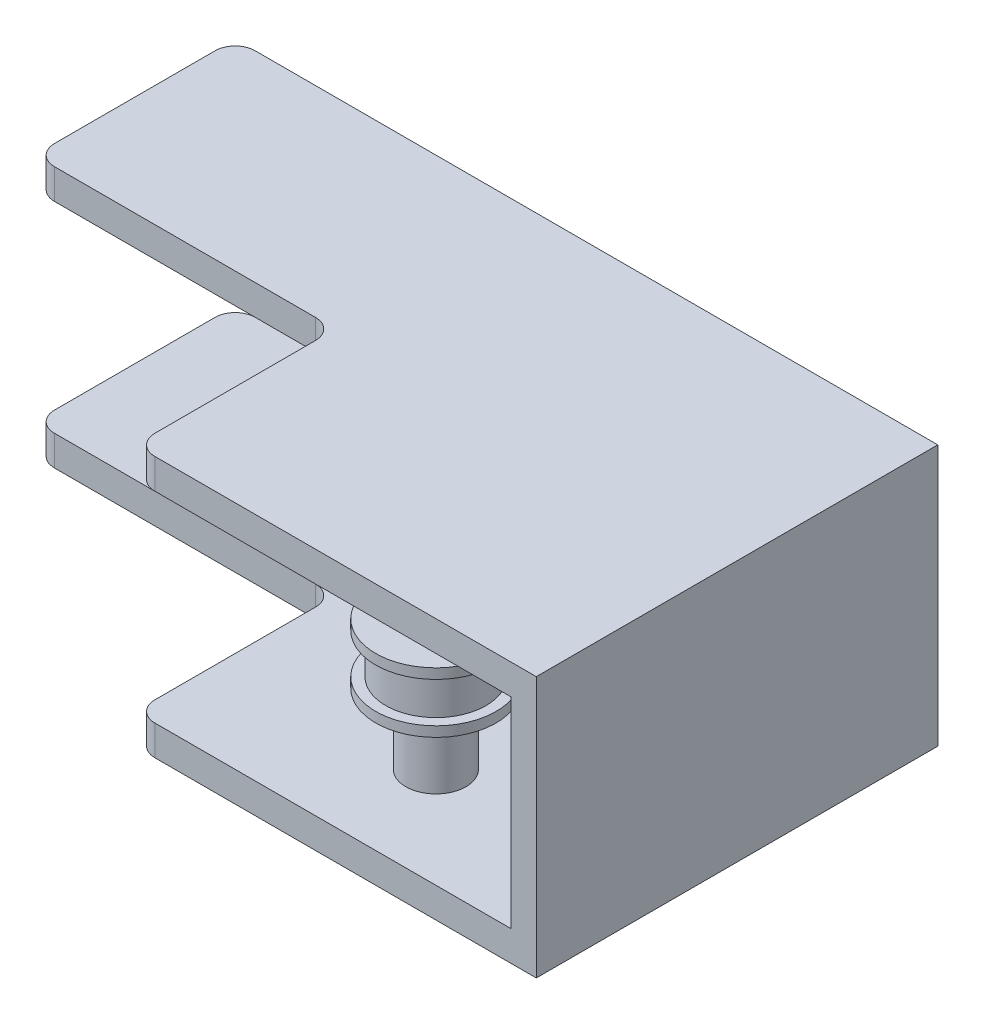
ISO-10303-21;
HEADER;
FILE_DESCRIPTION(('STEP AP214'),'2;1');
FILE_NAME('part.step','',(''),(''),'','','');
FILE_SCHEMA(('AUTOMOTIVE_DESIGN { 1 0 10303 214 1 1 1 1 }'));
ENDSEC;
DATA;
#1=APPLICATION_CONTEXT('core data for automotive mechanical design processes');
#2=APPLICATION_PROTOCOL_DEFINITION('international standard','automotive_design',2000,#1);
#3=PRODUCT_CONTEXT('',#1,'mechanical');
#4=PRODUCT('Part','Part','',(#3));
#5=PRODUCT_RELATED_PRODUCT_CATEGORY('part','',(#4));
#6=PRODUCT_DEFINITION_FORMATION('','',#4);
#7=PRODUCT_DEFINITION_CONTEXT('part definition',#1,'design');
#8=PRODUCT_DEFINITION('design','',#6,#7);
#9=PRODUCT_DEFINITION_SHAPE('','',#8);
#10=(LENGTH_UNIT() NAMED_UNIT(*) SI_UNIT(.MILLI.,.METRE.));
#11=(NAMED_UNIT(*) PLANE_ANGLE_UNIT() SI_UNIT($,.RADIAN.));
#12=(NAMED_UNIT(*) SI_UNIT($,.STERADIAN.) SOLID_ANGLE_UNIT());
#13=UNCERTAINTY_MEASURE_WITH_UNIT(LENGTH_MEASURE(1.E-05),#10,'distance_accuracy_value','');
#14=(GEOMETRIC_REPRESENTATION_CONTEXT(3) GLOBAL_UNCERTAINTY_ASSIGNED_CONTEXT((#13)) GLOBAL_UNIT_ASSIGNED_CONTEXT((#10,
#11,#12)) REPRESENTATION_CONTEXT('',''));
#15=CARTESIAN_POINT('',(0.,0.,0.));
#16=DIRECTION('',(0.,0.,1.));
#17=DIRECTION('',(1.,0.,0.));
#18=AXIS2_PLACEMENT_3D('',#15,#16,#17);
#19=CARTESIAN_POINT('',(-18.,0.,18.));
#20=DIRECTION('',(0.,-1.,0.));
#21=DIRECTION('',(0.,0.,-1.));
#22=AXIS2_PLACEMENT_3D('',#19,#20,#21);
#23=PLANE('',#22);
#24=CARTESIAN_POINT('',(0.,0.,10.));
#25=DIRECTION('',(0.,-1.,0.));
#26=DIRECTION('',(0.,0.,-1.));
#27=AXIS2_PLACEMENT_3D('',#24,#25,#26);
#28=CIRCLE('',#27,3.);
#29=CARTESIAN_POINT('',(0.,0.,7.));
#30=VERTEX_POINT('',#29);
#31=EDGE_CURVE('E237',#30,#30,#28,.T.);
#32=ORIENTED_EDGE('',*,*,#31,.F.);
#33=EDGE_LOOP('',(#32));
#34=FACE_BOUND('',#33,.T.);
#35=DIRECTION('',(-1.,0.,0.));
#36=VECTOR('',#35,1.);
#37=CARTESIAN_POINT('',(-48.,0.,-20.));
#38=LINE('',#37,#36);
#39=CARTESIAN_POINT('',(17.5,0.,-20.));
#40=VERTEX_POINT('',#39);
#41=CARTESIAN_POINT('',(-48.,0.,-20.));
#42=VERTEX_POINT('',#41);
#43=EDGE_CURVE('E161',#40,#42,#38,.T.);
#44=ORIENTED_EDGE('',*,*,#43,.F.);
#45=DIRECTION('',(0.,0.,-1.));
#46=VECTOR('',#45,1.);
#47=CARTESIAN_POINT('',(17.5,0.,-20.));
#48=LINE('',#47,#46);
#49=CARTESIAN_POINT('',(17.5,0.,20.));
#50=VERTEX_POINT('',#49);
#51=EDGE_CURVE('E317',#50,#40,#48,.T.);
#52=ORIENTED_EDGE('',*,*,#51,.F.);
#53=DIRECTION('',(1.,0.,0.));
#54=VECTOR('',#53,1.);
#55=CARTESIAN_POINT('',(18.,0.,20.));
#56=LINE('',#55,#54);
#57=CARTESIAN_POINT('',(-18.,0.,20.));
#58=VERTEX_POINT('',#57);
#59=EDGE_CURVE('E103',#58,#50,#56,.T.);
#60=ORIENTED_EDGE('',*,*,#59,.F.);
#61=CARTESIAN_POINT('',(-18.,0.,18.));
#62=DIRECTION('',(0.,1.,0.));
#63=DIRECTION('',(0.,0.,-1.));
#64=AXIS2_PLACEMENT_3D('',#61,#62,#63);
#65=CIRCLE('',#64,2.);
#66=CARTESIAN_POINT('',(-20.,0.,18.));
#67=VERTEX_POINT('',#66);
#68=EDGE_CURVE('E182',#67,#58,#65,.T.);
#69=ORIENTED_EDGE('',*,*,#68,.F.);
#70=DIRECTION('',(0.,0.,1.));
#71=VECTOR('',#70,1.);
#72=CARTESIAN_POINT('',(-20.,0.,2.00000000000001));
#73=LINE('',#72,#71);
#74=CARTESIAN_POINT('',(-20.,0.,2.00000000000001));
#75=VERTEX_POINT('',#74);
#76=EDGE_CURVE('E95',#75,#67,#73,.T.);
#77=ORIENTED_EDGE('',*,*,#76,.F.);
#78=CARTESIAN_POINT('',(-22.,0.,2.));
#79=DIRECTION('',(0.,-1.,0.));
#80=DIRECTION('',(0.,0.,1.));
#81=AXIS2_PLACEMENT_3D('',#78,#79,#80);
#82=CIRCLE('',#81,2.);
#83=CARTESIAN_POINT('',(-22.,0.,0.));
#84=VERTEX_POINT('',#83);
#85=EDGE_CURVE('E177',#84,#75,#82,.T.);
#86=ORIENTED_EDGE('',*,*,#85,.F.);
#87=DIRECTION('',(1.,0.,0.));
#88=VECTOR('',#87,1.);
#89=CARTESIAN_POINT('',(-22.,0.,0.));
#90=LINE('',#89,#88);
#91=CARTESIAN_POINT('',(-48.,0.,0.));
#92=VERTEX_POINT('',#91);
#93=EDGE_CURVE('E174',#92,#84,#90,.T.);
#94=ORIENTED_EDGE('',*,*,#93,.F.);
#95=CARTESIAN_POINT('',(-48.,0.,-2.));
#96=DIRECTION('',(0.,1.,0.));
#97=DIRECTION('',(0.,0.,-1.));
#98=AXIS2_PLACEMENT_3D('',#95,#96,#97);
#99=CIRCLE('',#98,2.);
#100=CARTESIAN_POINT('',(-50.,0.,-2.00000000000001));
#101=VERTEX_POINT('',#100);
#102=EDGE_CURVE('E171',#101,#92,#99,.T.);
#103=ORIENTED_EDGE('',*,*,#102,.F.);
#104=DIRECTION('',(0.,0.,1.));
#105=VECTOR('',#104,1.);
#106=CARTESIAN_POINT('',(-50.,0.,-2.00000000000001));
#107=LINE('',#106,#105);
#108=CARTESIAN_POINT('',(-50.,0.,-18.));
#109=VERTEX_POINT('',#108);
#110=EDGE_CURVE('E168',#109,#101,#107,.T.);
#111=ORIENTED_EDGE('',*,*,#110,.F.);
#112=CARTESIAN_POINT('',(-48.,0.,-18.));
#113=DIRECTION('',(0.,1.,0.));
#114=DIRECTION('',(0.,0.,1.));
#115=AXIS2_PLACEMENT_3D('',#112,#113,#114);
#116=CIRCLE('',#115,2.);
#117=EDGE_CURVE('E164',#42,#109,#116,.T.);
#118=ORIENTED_EDGE('',*,*,#117,.F.);
#119=EDGE_LOOP('',(#44,#52,#60,#69,#77,#86,#94,#103,#111,#118));
#120=FACE_BOUND('',#119,.T.);
#121=ADVANCED_FACE('F45',(#34,#120),#23,.T.);
#122=CARTESIAN_POINT('',(-48.,3.,-20.));
#123=DIRECTION('',(0.,0.,1.));
#124=DIRECTION('',(1.,0.,0.));
#125=AXIS2_PLACEMENT_3D('',#122,#123,#124);
#126=PLANE('',#125);
#127=DIRECTION('',(0.,-1.,0.));
#128=VECTOR('',#127,1.);
#129=CARTESIAN_POINT('',(20.,3.,-20.));
#130=LINE('',#129,#128);
#131=CARTESIAN_POINT('',(20.,3.,-20.));
#132=VERTEX_POINT('',#131);
#133=CARTESIAN_POINT('',(20.,-23.,-20.));
#134=VERTEX_POINT('',#133);
#135=EDGE_CURVE('E49',#132,#134,#130,.T.);
#136=ORIENTED_EDGE('',*,*,#135,.T.);
#137=DIRECTION('',(1.,0.,0.));
#138=VECTOR('',#137,1.);
#139=CARTESIAN_POINT('',(-48.,-23.,-20.));
#140=LINE('',#139,#138);
#141=CARTESIAN_POINT('',(-48.,-23.,-20.));
#142=VERTEX_POINT('',#141);
#143=EDGE_CURVE('E402',#142,#134,#140,.T.);
#144=ORIENTED_EDGE('',*,*,#143,.F.);
#145=DIRECTION('',(0.,1.,0.));
#146=VECTOR('',#145,1.);
#147=CARTESIAN_POINT('',(-48.,-23.,-20.));
#148=LINE('',#147,#146);
#149=CARTESIAN_POINT('',(-48.,-20.,-20.));
#150=VERTEX_POINT('',#149);
#151=EDGE_CURVE('E322',#142,#150,#148,.T.);
#152=ORIENTED_EDGE('',*,*,#151,.T.);
#153=DIRECTION('',(1.,0.,0.));
#154=VECTOR('',#153,1.);
#155=CARTESIAN_POINT('',(17.5,-20.,-20.));
#156=LINE('',#155,#154);
#157=CARTESIAN_POINT('',(17.5,-20.,-20.));
#158=VERTEX_POINT('',#157);
#159=EDGE_CURVE('E446',#150,#158,#156,.T.);
#160=ORIENTED_EDGE('',*,*,#159,.T.);
#161=DIRECTION('',(0.,1.,0.));
#162=VECTOR('',#161,1.);
#163=CARTESIAN_POINT('',(17.5,-20.,-20.));
#164=LINE('',#163,#162);
#165=EDGE_CURVE('E307',#158,#40,#164,.T.);
#166=ORIENTED_EDGE('',*,*,#165,.T.);
#167=ORIENTED_EDGE('',*,*,#43,.T.);
#168=DIRECTION('',(0.,-1.,0.));
#169=VECTOR('',#168,1.);
#170=CARTESIAN_POINT('',(-48.,3.,-20.));
#171=LINE('',#170,#169);
#172=CARTESIAN_POINT('',(-48.,3.,-20.));
#173=VERTEX_POINT('',#172);
#174=EDGE_CURVE('E210',#173,#42,#171,.T.);
#175=ORIENTED_EDGE('',*,*,#174,.F.);
#176=DIRECTION('',(-1.,0.,0.));
#177=VECTOR('',#176,1.);
#178=CARTESIAN_POINT('',(18.,3.,-20.));
#179=LINE('',#178,#177);
#180=EDGE_CURVE('E112',#132,#173,#179,.T.);
#181=ORIENTED_EDGE('',*,*,#180,.F.);
#182=EDGE_LOOP('',(#136,#144,#152,#160,#166,#167,#175,#181));
#183=FACE_BOUND('',#182,.T.);
#184=ADVANCED_FACE('F47',(#183),#126,.F.);
#185=CARTESIAN_POINT('',(-48.,3.,-18.));
#186=DIRECTION('',(0.,-1.,0.));
#187=DIRECTION('',(0.,0.,-1.));
#188=AXIS2_PLACEMENT_3D('',#185,#186,#187);
#189=CYLINDRICAL_SURFACE('',#188,2.);
#190=ORIENTED_EDGE('',*,*,#117,.T.);
#191=DIRECTION('',(0.,-1.,0.));
#192=VECTOR('',#191,1.);
#193=CARTESIAN_POINT('',(-50.,3.,-18.));
#194=LINE('',#193,#192);
#195=CARTESIAN_POINT('',(-50.,3.,-18.));
#196=VERTEX_POINT('',#195);
#197=EDGE_CURVE('E207',#196,#109,#194,.T.);
#198=ORIENTED_EDGE('',*,*,#197,.F.);
#199=CARTESIAN_POINT('',(-48.,3.,-18.));
#200=DIRECTION('',(0.,1.,0.));
#201=DIRECTION('',(0.,0.,1.));
#202=AXIS2_PLACEMENT_3D('',#199,#200,#201);
#203=CIRCLE('',#202,2.);
#204=EDGE_CURVE('E252',#173,#196,#203,.T.);
#205=ORIENTED_EDGE('',*,*,#204,.F.);
#206=ORIENTED_EDGE('',*,*,#174,.T.);
#207=EDGE_LOOP('',(#190,#198,#205,#206));
#208=FACE_BOUND('',#207,.T.);
#209=ADVANCED_FACE('F495',(#208),#189,.T.);
#210=CARTESIAN_POINT('',(-50.,3.,-2.00000000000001));
#211=DIRECTION('',(1.,0.,0.));
#212=DIRECTION('',(0.,0.,-1.));
#213=AXIS2_PLACEMENT_3D('',#210,#211,#212);
#214=PLANE('',#213);
#215=ORIENTED_EDGE('',*,*,#110,.T.);
#216=DIRECTION('',(0.,-1.,0.));
#217=VECTOR('',#216,1.);
#218=CARTESIAN_POINT('',(-50.,3.,-2.00000000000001));
#219=LINE('',#218,#217);
#220=CARTESIAN_POINT('',(-50.,3.,-2.00000000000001));
#221=VERTEX_POINT('',#220);
#222=EDGE_CURVE('E203',#221,#101,#219,.T.);
#223=ORIENTED_EDGE('',*,*,#222,.F.);
#224=DIRECTION('',(0.,0.,1.));
#225=VECTOR('',#224,1.);
#226=CARTESIAN_POINT('',(-50.,3.,-2.00000000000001));
#227=LINE('',#226,#225);
#228=EDGE_CURVE('E255',#196,#221,#227,.T.);
#229=ORIENTED_EDGE('',*,*,#228,.F.);
#230=ORIENTED_EDGE('',*,*,#197,.T.);
#231=EDGE_LOOP('',(#215,#223,#229,#230));
#232=FACE_BOUND('',#231,.T.);
#233=ADVANCED_FACE('F498',(#232),#214,.F.);
#234=CARTESIAN_POINT('',(-48.,3.,-2.));
#235=DIRECTION('',(0.,-1.,0.));
#236=DIRECTION('',(0.,0.,-1.));
#237=AXIS2_PLACEMENT_3D('',#234,#235,#236);
#238=CYLINDRICAL_SURFACE('',#237,2.);
#239=ORIENTED_EDGE('',*,*,#102,.T.);
#240=DIRECTION('',(0.,-1.,0.));
#241=VECTOR('',#240,1.);
#242=CARTESIAN_POINT('',(-48.,3.,0.));
#243=LINE('',#242,#241);
#244=CARTESIAN_POINT('',(-48.,3.,0.));
#245=VERTEX_POINT('',#244);
#246=EDGE_CURVE('E199',#245,#92,#243,.T.);
#247=ORIENTED_EDGE('',*,*,#246,.F.);
#248=CARTESIAN_POINT('',(-48.,3.,-2.));
#249=DIRECTION('',(0.,1.,0.));
#250=DIRECTION('',(0.,0.,-1.));
#251=AXIS2_PLACEMENT_3D('',#248,#249,#250);
#252=CIRCLE('',#251,2.);
#253=EDGE_CURVE('E258',#221,#245,#252,.T.);
#254=ORIENTED_EDGE('',*,*,#253,.F.);
#255=ORIENTED_EDGE('',*,*,#222,.T.);
#256=EDGE_LOOP('',(#239,#247,#254,#255));
#257=FACE_BOUND('',#256,.T.);
#258=ADVANCED_FACE('F594',(#257),#238,.T.);
#259=CARTESIAN_POINT('',(-22.,3.,0.));
#260=DIRECTION('',(0.,0.,-1.));
#261=DIRECTION('',(-1.,0.,0.));
#262=AXIS2_PLACEMENT_3D('',#259,#260,#261);
#263=PLANE('',#262);
#264=ORIENTED_EDGE('',*,*,#93,.T.);
#265=DIRECTION('',(0.,-1.,0.));
#266=VECTOR('',#265,1.);
#267=CARTESIAN_POINT('',(-22.,3.,0.));
#268=LINE('',#267,#266);
#269=CARTESIAN_POINT('',(-22.,3.,0.));
#270=VERTEX_POINT('',#269);
#271=EDGE_CURVE('E195',#270,#84,#268,.T.);
#272=ORIENTED_EDGE('',*,*,#271,.F.);
#273=DIRECTION('',(1.,0.,0.));
#274=VECTOR('',#273,1.);
#275=CARTESIAN_POINT('',(-22.,3.,0.));
#276=LINE('',#275,#274);
#277=EDGE_CURVE('E261',#245,#270,#276,.T.);
#278=ORIENTED_EDGE('',*,*,#277,.F.);
#279=ORIENTED_EDGE('',*,*,#246,.T.);
#280=EDGE_LOOP('',(#264,#272,#278,#279));
#281=FACE_BOUND('',#280,.T.);
#282=ADVANCED_FACE('F590',(#281),#263,.F.);
#283=CARTESIAN_POINT('',(-22.,3.,2.));
#284=DIRECTION('',(0.,-1.,0.));
#285=DIRECTION('',(0.,0.,-1.));
#286=AXIS2_PLACEMENT_3D('',#283,#284,#285);
#287=CYLINDRICAL_SURFACE('',#286,2.);
#288=ORIENTED_EDGE('',*,*,#85,.T.);
#289=DIRECTION('',(0.,-1.,0.));
#290=VECTOR('',#289,1.);
#291=CARTESIAN_POINT('',(-20.,3.,2.00000000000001));
#292=LINE('',#291,#290);
#293=CARTESIAN_POINT('',(-20.,3.,2.00000000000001));
#294=VERTEX_POINT('',#293);
#295=EDGE_CURVE('E148',#294,#75,#292,.T.);
#296=ORIENTED_EDGE('',*,*,#295,.F.);
#297=CARTESIAN_POINT('',(-22.,3.,2.));
#298=DIRECTION('',(0.,-1.,0.));
#299=DIRECTION('',(0.,0.,1.));
#300=AXIS2_PLACEMENT_3D('',#297,#298,#299);
#301=CIRCLE('',#300,2.);
#302=EDGE_CURVE('E140',#270,#294,#301,.T.);
#303=ORIENTED_EDGE('',*,*,#302,.F.);
#304=ORIENTED_EDGE('',*,*,#271,.T.);
#305=EDGE_LOOP('',(#288,#296,#303,#304));
#306=FACE_BOUND('',#305,.T.);
#307=ADVANCED_FACE('F587',(#306),#287,.F.);
#308=CARTESIAN_POINT('',(-20.,3.,2.00000000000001));
#309=DIRECTION('',(1.,0.,0.));
#310=DIRECTION('',(0.,0.,-1.));
#311=AXIS2_PLACEMENT_3D('',#308,#309,#310);
#312=PLANE('',#311);
#313=ORIENTED_EDGE('',*,*,#76,.T.);
#314=DIRECTION('',(0.,-1.,0.));
#315=VECTOR('',#314,1.);
#316=CARTESIAN_POINT('',(-20.,3.,18.));
#317=LINE('',#316,#315);
#318=CARTESIAN_POINT('',(-20.,3.,18.));
#319=VERTEX_POINT('',#318);
#320=EDGE_CURVE('E144',#319,#67,#317,.T.);
#321=ORIENTED_EDGE('',*,*,#320,.F.);
#322=DIRECTION('',(0.,0.,1.));
#323=VECTOR('',#322,1.);
#324=CARTESIAN_POINT('',(-20.,3.,2.00000000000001));
#325=LINE('',#324,#323);
#326=EDGE_CURVE('E134',#294,#319,#325,.T.);
#327=ORIENTED_EDGE('',*,*,#326,.F.);
#328=ORIENTED_EDGE('',*,*,#295,.T.);
#329=EDGE_LOOP('',(#313,#321,#327,#328));
#330=FACE_BOUND('',#329,.T.);
#331=ADVANCED_FACE('F145',(#330),#312,.F.);
#332=CARTESIAN_POINT('',(-18.,3.,18.));
#333=DIRECTION('',(0.,-1.,0.));
#334=DIRECTION('',(0.,0.,-1.));
#335=AXIS2_PLACEMENT_3D('',#332,#333,#334);
#336=CYLINDRICAL_SURFACE('',#335,2.);
#337=ORIENTED_EDGE('',*,*,#68,.T.);
#338=DIRECTION('',(0.,-1.,0.));
#339=VECTOR('',#338,1.);
#340=CARTESIAN_POINT('',(-18.,3.,20.));
#341=LINE('',#340,#339);
#342=CARTESIAN_POINT('',(-18.,3.,20.));
#343=VERTEX_POINT('',#342);
#344=EDGE_CURVE('E149',#343,#58,#341,.T.);
#345=ORIENTED_EDGE('',*,*,#344,.F.);
#346=CARTESIAN_POINT('',(-18.,3.,18.));
#347=DIRECTION('',(0.,1.,0.));
#348=DIRECTION('',(0.,0.,-1.));
#349=AXIS2_PLACEMENT_3D('',#346,#347,#348);
#350=CIRCLE('',#349,2.);
#351=EDGE_CURVE('E137',#319,#343,#350,.T.);
#352=ORIENTED_EDGE('',*,*,#351,.F.);
#353=ORIENTED_EDGE('',*,*,#320,.T.);
#354=EDGE_LOOP('',(#337,#345,#352,#353));
#355=FACE_BOUND('',#354,.T.);
#356=ADVANCED_FACE('F151',(#355),#336,.T.);
#357=CARTESIAN_POINT('',(18.,3.,20.));
#358=DIRECTION('',(0.,0.,-1.));
#359=DIRECTION('',(-1.,0.,0.));
#360=AXIS2_PLACEMENT_3D('',#357,#358,#359);
#361=PLANE('',#360);
#362=ORIENTED_EDGE('',*,*,#59,.T.);
#363=DIRECTION('',(0.,1.,0.));
#364=VECTOR('',#363,1.);
#365=CARTESIAN_POINT('',(17.5,-20.,20.));
#366=LINE('',#365,#364);
#367=CARTESIAN_POINT('',(17.5,-20.,20.));
#368=VERTEX_POINT('',#367);
#369=EDGE_CURVE('E302',#368,#50,#366,.T.);
#370=ORIENTED_EDGE('',*,*,#369,.F.);
#371=DIRECTION('',(-1.,0.,0.));
#372=VECTOR('',#371,1.);
#373=CARTESIAN_POINT('',(17.5,-20.,20.));
#374=LINE('',#373,#372);
#375=CARTESIAN_POINT('',(-18.,-20.,20.));
#376=VERTEX_POINT('',#375);
#377=EDGE_CURVE('E441',#368,#376,#374,.T.);
#378=ORIENTED_EDGE('',*,*,#377,.T.);
#379=DIRECTION('',(0.,1.,0.));
#380=VECTOR('',#379,1.);
#381=CARTESIAN_POINT('',(-18.,-23.,20.));
#382=LINE('',#381,#380);
#383=CARTESIAN_POINT('',(-18.,-23.,20.));
#384=VERTEX_POINT('',#383);
#385=EDGE_CURVE('E327',#384,#376,#382,.T.);
#386=ORIENTED_EDGE('',*,*,#385,.F.);
#387=DIRECTION('',(-1.,0.,0.));
#388=VECTOR('',#387,1.);
#389=CARTESIAN_POINT('',(20.,-23.,20.));
#390=LINE('',#389,#388);
#391=CARTESIAN_POINT('',(20.,-23.,20.));
#392=VERTEX_POINT('',#391);
#393=EDGE_CURVE('E392',#392,#384,#390,.T.);
#394=ORIENTED_EDGE('',*,*,#393,.F.);
#395=DIRECTION('',(0.,-1.,0.));
#396=VECTOR('',#395,1.);
#397=CARTESIAN_POINT('',(20.,3.,20.));
#398=LINE('',#397,#396);
#399=CARTESIAN_POINT('',(20.,3.,20.));
#400=VERTEX_POINT('',#399);
#401=EDGE_CURVE('E157',#400,#392,#398,.T.);
#402=ORIENTED_EDGE('',*,*,#401,.F.);
#403=DIRECTION('',(1.,0.,0.));
#404=VECTOR('',#403,1.);
#405=CARTESIAN_POINT('',(-18.,3.,20.));
#406=LINE('',#405,#404);
#407=EDGE_CURVE('E65',#343,#400,#406,.T.);
#408=ORIENTED_EDGE('',*,*,#407,.F.);
#409=ORIENTED_EDGE('',*,*,#344,.T.);
#410=EDGE_LOOP('',(#362,#370,#378,#386,#394,#402,#408,#409));
#411=FACE_BOUND('',#410,.T.);
#412=ADVANCED_FACE('F515',(#411),#361,.F.);
#413=CARTESIAN_POINT('',(20.,3.,18.));
#414=DIRECTION('',(-1.,0.,0.));
#415=DIRECTION('',(0.,0.,1.));
#416=AXIS2_PLACEMENT_3D('',#413,#414,#415);
#417=PLANE('',#416);
#418=ORIENTED_EDGE('',*,*,#401,.T.);
#419=DIRECTION('',(0.,0.,1.));
#420=VECTOR('',#419,1.);
#421=CARTESIAN_POINT('',(20.,-23.,-20.));
#422=LINE('',#421,#420);
#423=EDGE_CURVE('E397',#134,#392,#422,.T.);
#424=ORIENTED_EDGE('',*,*,#423,.F.);
#425=ORIENTED_EDGE('',*,*,#135,.F.);
#426=DIRECTION('',(0.,0.,-1.));
#427=VECTOR('',#426,1.);
#428=CARTESIAN_POINT('',(20.,3.,-20.));
#429=LINE('',#428,#427);
#430=EDGE_CURVE('E187',#400,#132,#429,.T.);
#431=ORIENTED_EDGE('',*,*,#430,.F.);
#432=EDGE_LOOP('',(#418,#424,#425,#431));
#433=FACE_BOUND('',#432,.T.);
#434=ADVANCED_FACE('F505',(#433),#417,.F.);
#435=CARTESIAN_POINT('',(-18.,3.,18.));
#436=DIRECTION('',(0.,-1.,0.));
#437=DIRECTION('',(0.,0.,-1.));
#438=AXIS2_PLACEMENT_3D('',#435,#436,#437);
#439=PLANE('',#438);
#440=ORIENTED_EDGE('',*,*,#430,.T.);
#441=ORIENTED_EDGE('',*,*,#180,.T.);
#442=ORIENTED_EDGE('',*,*,#204,.T.);
#443=ORIENTED_EDGE('',*,*,#228,.T.);
#444=ORIENTED_EDGE('',*,*,#253,.T.);
#445=ORIENTED_EDGE('',*,*,#277,.T.);
#446=ORIENTED_EDGE('',*,*,#302,.T.);
#447=ORIENTED_EDGE('',*,*,#326,.T.);
#448=ORIENTED_EDGE('',*,*,#351,.T.);
#449=ORIENTED_EDGE('',*,*,#407,.T.);
#450=EDGE_LOOP('',(#440,#441,#442,#443,#444,#445,#446,#447,#448,#449));
#451=FACE_BOUND('',#450,.T.);
#452=ADVANCED_FACE('F135',(#451),#439,.F.);
#453=CARTESIAN_POINT('',(0.,-7.,10.));
#454=DIRECTION('',(0.,1.,0.));
#455=DIRECTION('',(0.,0.,1.));
#456=AXIS2_PLACEMENT_3D('',#453,#454,#455);
#457=CYLINDRICAL_SURFACE('',#456,3.);
#458=CARTESIAN_POINT('',(0.,-7.,10.));
#459=DIRECTION('',(0.,-1.,0.));
#460=DIRECTION('',(0.,0.,-1.));
#461=AXIS2_PLACEMENT_3D('',#458,#459,#460);
#462=CIRCLE('',#461,3.);
#463=CARTESIAN_POINT('',(0.,-7.,7.));
#464=VERTEX_POINT('',#463);
#465=EDGE_CURVE('E165',#464,#464,#462,.T.);
#466=ORIENTED_EDGE('',*,*,#465,.F.);
#467=EDGE_LOOP('',(#466));
#468=FACE_BOUND('',#467,.T.);
#469=ORIENTED_EDGE('',*,*,#31,.T.);
#470=EDGE_LOOP('',(#469));
#471=FACE_BOUND('',#470,.T.);
#472=ADVANCED_FACE('F642',(#468,#471),#457,.T.);
#473=CARTESIAN_POINT('',(0.,-8.,10.));
#474=DIRECTION('',(0.,1.,0.));
#475=DIRECTION('',(0.,0.,1.));
#476=AXIS2_PLACEMENT_3D('',#473,#474,#475);
#477=CYLINDRICAL_SURFACE('',#476,6.);
#478=CARTESIAN_POINT('',(0.,-8.,10.));
#479=DIRECTION('',(0.,-1.,0.));
#480=DIRECTION('',(0.,0.,-1.));
#481=AXIS2_PLACEMENT_3D('',#478,#479,#480);
#482=CIRCLE('',#481,6.);
#483=CARTESIAN_POINT('',(0.,-8.,4.));
#484=VERTEX_POINT('',#483);
#485=EDGE_CURVE('E233',#484,#484,#482,.T.);
#486=ORIENTED_EDGE('',*,*,#485,.F.);
#487=EDGE_LOOP('',(#486));
#488=FACE_BOUND('',#487,.T.);
#489=CARTESIAN_POINT('',(0.,-7.,10.));
#490=DIRECTION('',(0.,-1.,0.));
#491=DIRECTION('',(0.,0.,-1.));
#492=AXIS2_PLACEMENT_3D('',#489,#490,#491);
#493=CIRCLE('',#492,6.);
#494=CARTESIAN_POINT('',(0.,-7.,4.));
#495=VERTEX_POINT('',#494);
#496=EDGE_CURVE('E238',#495,#495,#493,.T.);
#497=ORIENTED_EDGE('',*,*,#496,.T.);
#498=EDGE_LOOP('',(#497));
#499=FACE_BOUND('',#498,.T.);
#500=ADVANCED_FACE('F650',(#488,#499),#477,.T.);
#501=CARTESIAN_POINT('',(0.,-8.,10.));
#502=DIRECTION('',(0.,-1.,0.));
#503=DIRECTION('',(0.,0.,-1.));
#504=AXIS2_PLACEMENT_3D('',#501,#502,#503);
#505=PLANE('',#504);
#506=CARTESIAN_POINT('',(0.,-8.,10.));
#507=DIRECTION('',(0.,-1.,0.));
#508=DIRECTION('',(0.,0.,-1.));
#509=AXIS2_PLACEMENT_3D('',#506,#507,#508);
#510=CIRCLE('',#509,5.);
#511=CARTESIAN_POINT('',(0.,-8.,5.));
#512=VERTEX_POINT('',#511);
#513=EDGE_CURVE('E56',#512,#512,#510,.T.);
#514=ORIENTED_EDGE('',*,*,#513,.F.);
#515=EDGE_LOOP('',(#514));
#516=FACE_BOUND('',#515,.T.);
#517=ORIENTED_EDGE('',*,*,#485,.T.);
#518=EDGE_LOOP('',(#517));
#519=FACE_BOUND('',#518,.T.);
#520=ADVANCED_FACE('F658',(#516,#519),#505,.T.);
#521=CARTESIAN_POINT('',(0.,-7.,10.));
#522=DIRECTION('',(0.,-1.,0.));
#523=DIRECTION('',(0.,0.,-1.));
#524=AXIS2_PLACEMENT_3D('',#521,#522,#523);
#525=PLANE('',#524);
#526=ORIENTED_EDGE('',*,*,#465,.T.);
#527=EDGE_LOOP('',(#526));
#528=FACE_BOUND('',#527,.T.);
#529=ORIENTED_EDGE('',*,*,#496,.F.);
#530=EDGE_LOOP('',(#529));
#531=FACE_BOUND('',#530,.T.);
#532=ADVANCED_FACE('F665',(#528,#531),#525,.F.);
#533=CARTESIAN_POINT('',(0.,-12.,10.));
#534=DIRECTION('',(0.,1.,0.));
#535=DIRECTION('',(0.,0.,1.));
#536=AXIS2_PLACEMENT_3D('',#533,#534,#535);
#537=CYLINDRICAL_SURFACE('',#536,5.);
#538=CARTESIAN_POINT('',(0.,-12.,10.));
#539=DIRECTION('',(0.,-1.,0.));
#540=DIRECTION('',(0.,0.,-1.));
#541=AXIS2_PLACEMENT_3D('',#538,#539,#540);
#542=CIRCLE('',#541,5.);
#543=CARTESIAN_POINT('',(0.,-12.,5.));
#544=VERTEX_POINT('',#543);
#545=EDGE_CURVE('E231',#544,#544,#542,.T.);
#546=ORIENTED_EDGE('',*,*,#545,.F.);
#547=EDGE_LOOP('',(#546));
#548=FACE_BOUND('',#547,.T.);
#549=ORIENTED_EDGE('',*,*,#513,.T.);
#550=EDGE_LOOP('',(#549));
#551=FACE_BOUND('',#550,.T.);
#552=ADVANCED_FACE('F669',(#548,#551),#537,.T.);
#553=CARTESIAN_POINT('',(0.,-13.,10.));
#554=DIRECTION('',(0.,1.,0.));
#555=DIRECTION('',(0.,0.,1.));
#556=AXIS2_PLACEMENT_3D('',#553,#554,#555);
#557=CYLINDRICAL_SURFACE('',#556,6.);
#558=CARTESIAN_POINT('',(0.,-13.,10.));
#559=DIRECTION('',(0.,-1.,0.));
#560=DIRECTION('',(0.,0.,-1.));
#561=AXIS2_PLACEMENT_3D('',#558,#559,#560);
#562=CIRCLE('',#561,6.);
#563=CARTESIAN_POINT('',(0.,-13.,4.));
#564=VERTEX_POINT('',#563);
#565=EDGE_CURVE('E289',#564,#564,#562,.T.);
#566=ORIENTED_EDGE('',*,*,#565,.F.);
#567=EDGE_LOOP('',(#566));
#568=FACE_BOUND('',#567,.T.);
#569=CARTESIAN_POINT('',(0.,-12.,10.));
#570=DIRECTION('',(0.,-1.,0.));
#571=DIRECTION('',(0.,0.,-1.));
#572=AXIS2_PLACEMENT_3D('',#569,#570,#571);
#573=CIRCLE('',#572,6.);
#574=CARTESIAN_POINT('',(0.,-12.,4.));
#575=VERTEX_POINT('',#574);
#576=EDGE_CURVE('E293',#575,#575,#573,.T.);
#577=ORIENTED_EDGE('',*,*,#576,.T.);
#578=EDGE_LOOP('',(#577));
#579=FACE_BOUND('',#578,.T.);
#580=ADVANCED_FACE('F685',(#568,#579),#557,.T.);
#581=CARTESIAN_POINT('',(0.,-13.,10.));
#582=DIRECTION('',(0.,-1.,0.));
#583=DIRECTION('',(0.,0.,-1.));
#584=AXIS2_PLACEMENT_3D('',#581,#582,#583);
#585=PLANE('',#584);
#586=CARTESIAN_POINT('',(0.,-13.,10.));
#587=DIRECTION('',(0.,-1.,0.));
#588=DIRECTION('',(0.,0.,-1.));
#589=AXIS2_PLACEMENT_3D('',#586,#587,#588);
#590=CIRCLE('',#589,3.);
#591=CARTESIAN_POINT('',(0.,-13.,7.));
#592=VERTEX_POINT('',#591);
#593=EDGE_CURVE('E11',#592,#592,#590,.T.);
#594=ORIENTED_EDGE('',*,*,#593,.F.);
#595=EDGE_LOOP('',(#594));
#596=FACE_BOUND('',#595,.T.);
#597=ORIENTED_EDGE('',*,*,#565,.T.);
#598=EDGE_LOOP('',(#597));
#599=FACE_BOUND('',#598,.T.);
#600=ADVANCED_FACE('F694',(#596,#599),#585,.T.);
#601=CARTESIAN_POINT('',(0.,-12.,10.));
#602=DIRECTION('',(0.,-1.,0.));
#603=DIRECTION('',(0.,0.,-1.));
#604=AXIS2_PLACEMENT_3D('',#601,#602,#603);
#605=PLANE('',#604);
#606=ORIENTED_EDGE('',*,*,#545,.T.);
#607=EDGE_LOOP('',(#606));
#608=FACE_BOUND('',#607,.T.);
#609=ORIENTED_EDGE('',*,*,#576,.F.);
#610=EDGE_LOOP('',(#609));
#611=FACE_BOUND('',#610,.T.);
#612=ADVANCED_FACE('F701',(#608,#611),#605,.F.);
#613=CARTESIAN_POINT('',(0.,-20.,10.));
#614=DIRECTION('',(0.,1.,0.));
#615=DIRECTION('',(0.,0.,1.));
#616=AXIS2_PLACEMENT_3D('',#613,#614,#615);
#617=CYLINDRICAL_SURFACE('',#616,3.);
#618=CARTESIAN_POINT('',(0.,-20.,10.));
#619=DIRECTION('',(0.,-1.,0.));
#620=DIRECTION('',(0.,0.,-1.));
#621=AXIS2_PLACEMENT_3D('',#618,#619,#620);
#622=CIRCLE('',#621,3.);
#623=CARTESIAN_POINT('',(0.,-20.,7.));
#624=VERTEX_POINT('',#623);
#625=EDGE_CURVE('E298',#624,#624,#622,.T.);
#626=ORIENTED_EDGE('',*,*,#625,.F.);
#627=EDGE_LOOP('',(#626));
#628=FACE_BOUND('',#627,.T.);
#629=ORIENTED_EDGE('',*,*,#593,.T.);
#630=EDGE_LOOP('',(#629));
#631=FACE_BOUND('',#630,.T.);
#632=ADVANCED_FACE('F705',(#628,#631),#617,.T.);
#633=CARTESIAN_POINT('',(17.5,-20.,-20.));
#634=DIRECTION('',(1.,0.,0.));
#635=DIRECTION('',(0.,0.,-1.));
#636=AXIS2_PLACEMENT_3D('',#633,#634,#635);
#637=PLANE('',#636);
#638=ORIENTED_EDGE('',*,*,#51,.T.);
#639=ORIENTED_EDGE('',*,*,#165,.F.);
#640=DIRECTION('',(0.,0.,-1.));
#641=VECTOR('',#640,1.);
#642=CARTESIAN_POINT('',(17.5,-20.,-20.));
#643=LINE('',#642,#641);
#644=EDGE_CURVE('E312',#368,#158,#643,.T.);
#645=ORIENTED_EDGE('',*,*,#644,.F.);
#646=ORIENTED_EDGE('',*,*,#369,.T.);
#647=EDGE_LOOP('',(#638,#639,#645,#646));
#648=FACE_BOUND('',#647,.T.);
#649=ADVANCED_FACE('F490',(#648),#637,.F.);
#650=CARTESIAN_POINT('',(-48.,-20.,-18.));
#651=DIRECTION('',(0.,-1.,0.));
#652=DIRECTION('',(0.,0.,-1.));
#653=AXIS2_PLACEMENT_3D('',#650,#651,#652);
#654=PLANE('',#653);
#655=ORIENTED_EDGE('',*,*,#377,.F.);
#656=ORIENTED_EDGE('',*,*,#644,.T.);
#657=ORIENTED_EDGE('',*,*,#159,.F.);
#658=CARTESIAN_POINT('',(-48.,-20.,-18.));
#659=DIRECTION('',(0.,-1.,0.));
#660=DIRECTION('',(0.,0.,-1.));
#661=AXIS2_PLACEMENT_3D('',#658,#659,#660);
#662=CIRCLE('',#661,2.);
#663=CARTESIAN_POINT('',(-50.,-20.,-18.));
#664=VERTEX_POINT('',#663);
#665=EDGE_CURVE('E451',#664,#150,#662,.T.);
#666=ORIENTED_EDGE('',*,*,#665,.F.);
#667=DIRECTION('',(0.,0.,-1.));
#668=VECTOR('',#667,1.);
#669=CARTESIAN_POINT('',(-50.,-20.,-2.00000000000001));
#670=LINE('',#669,#668);
#671=CARTESIAN_POINT('',(-50.,-20.,-2.00000000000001));
#672=VERTEX_POINT('',#671);
#673=EDGE_CURVE('E411',#672,#664,#670,.T.);
#674=ORIENTED_EDGE('',*,*,#673,.F.);
#675=CARTESIAN_POINT('',(-48.,-20.,-2.));
#676=DIRECTION('',(0.,-1.,0.));
#677=DIRECTION('',(0.,0.,-1.));
#678=AXIS2_PLACEMENT_3D('',#675,#676,#677);
#679=CIRCLE('',#678,2.);
#680=CARTESIAN_POINT('',(-48.,-20.,0.));
#681=VERTEX_POINT('',#680);
#682=EDGE_CURVE('E416',#681,#672,#679,.T.);
#683=ORIENTED_EDGE('',*,*,#682,.F.);
#684=DIRECTION('',(-1.,0.,0.));
#685=VECTOR('',#684,1.);
#686=CARTESIAN_POINT('',(-22.,-20.,0.));
#687=LINE('',#686,#685);
#688=CARTESIAN_POINT('',(-22.,-20.,0.));
#689=VERTEX_POINT('',#688);
#690=EDGE_CURVE('E421',#689,#681,#687,.T.);
#691=ORIENTED_EDGE('',*,*,#690,.F.);
#692=CARTESIAN_POINT('',(-22.,-20.,2.));
#693=DIRECTION('',(0.,1.,0.));
#694=DIRECTION('',(0.,0.,-1.));
#695=AXIS2_PLACEMENT_3D('',#692,#693,#694);
#696=CIRCLE('',#695,2.);
#697=CARTESIAN_POINT('',(-20.,-20.,2.00000000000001));
#698=VERTEX_POINT('',#697);
#699=EDGE_CURVE('E426',#698,#689,#696,.T.);
#700=ORIENTED_EDGE('',*,*,#699,.F.);
#701=DIRECTION('',(0.,0.,-1.));
#702=VECTOR('',#701,1.);
#703=CARTESIAN_POINT('',(-20.,-20.,18.));
#704=LINE('',#703,#702);
#705=CARTESIAN_POINT('',(-20.,-20.,18.));
#706=VERTEX_POINT('',#705);
#707=EDGE_CURVE('E431',#706,#698,#704,.T.);
#708=ORIENTED_EDGE('',*,*,#707,.F.);
#709=CARTESIAN_POINT('',(-18.,-20.,18.));
#710=DIRECTION('',(0.,-1.,0.));
#711=DIRECTION('',(0.,0.,-1.));
#712=AXIS2_PLACEMENT_3D('',#709,#710,#711);
#713=CIRCLE('',#712,2.);
#714=EDGE_CURVE('E436',#376,#706,#713,.T.);
#715=ORIENTED_EDGE('',*,*,#714,.F.);
#716=EDGE_LOOP('',(#655,#656,#657,#666,#674,#683,#691,#700,#708,#715));
#717=FACE_BOUND('',#716,.T.);
#718=ORIENTED_EDGE('',*,*,#625,.T.);
#719=EDGE_LOOP('',(#718));
#720=FACE_BOUND('',#719,.T.);
#721=ADVANCED_FACE('F471',(#717,#720),#654,.F.);
#722=CARTESIAN_POINT('',(-48.,-23.,-18.));
#723=DIRECTION('',(0.,1.,0.));
#724=DIRECTION('',(0.,0.,1.));
#725=AXIS2_PLACEMENT_3D('',#722,#723,#724);
#726=CYLINDRICAL_SURFACE('',#725,2.);
#727=ORIENTED_EDGE('',*,*,#665,.T.);
#728=ORIENTED_EDGE('',*,*,#151,.F.);
#729=CARTESIAN_POINT('',(-48.,-23.,-18.));
#730=DIRECTION('',(0.,-1.,0.));
#731=DIRECTION('',(0.,0.,-1.));
#732=AXIS2_PLACEMENT_3D('',#729,#730,#731);
#733=CIRCLE('',#732,2.);
#734=CARTESIAN_POINT('',(-50.,-23.,-18.));
#735=VERTEX_POINT('',#734);
#736=EDGE_CURVE('E406',#735,#142,#733,.T.);
#737=ORIENTED_EDGE('',*,*,#736,.F.);
#738=DIRECTION('',(0.,1.,0.));
#739=VECTOR('',#738,1.);
#740=CARTESIAN_POINT('',(-50.,-23.,-18.));
#741=LINE('',#740,#739);
#742=EDGE_CURVE('E357',#735,#664,#741,.T.);
#743=ORIENTED_EDGE('',*,*,#742,.T.);
#744=EDGE_LOOP('',(#727,#728,#737,#743));
#745=FACE_BOUND('',#744,.T.);
#746=ADVANCED_FACE('F460',(#745),#726,.T.);
#747=CARTESIAN_POINT('',(-18.,-23.,18.));
#748=DIRECTION('',(0.,1.,0.));
#749=DIRECTION('',(0.,0.,1.));
#750=AXIS2_PLACEMENT_3D('',#747,#748,#749);
#751=CYLINDRICAL_SURFACE('',#750,2.);
#752=ORIENTED_EDGE('',*,*,#714,.T.);
#753=DIRECTION('',(0.,1.,0.));
#754=VECTOR('',#753,1.);
#755=CARTESIAN_POINT('',(-20.,-23.,18.));
#756=LINE('',#755,#754);
#757=CARTESIAN_POINT('',(-20.,-23.,18.));
#758=VERTEX_POINT('',#757);
#759=EDGE_CURVE('E332',#758,#706,#756,.T.);
#760=ORIENTED_EDGE('',*,*,#759,.F.);
#761=CARTESIAN_POINT('',(-18.,-23.,18.));
#762=DIRECTION('',(0.,-1.,0.));
#763=DIRECTION('',(0.,0.,-1.));
#764=AXIS2_PLACEMENT_3D('',#761,#762,#763);
#765=CIRCLE('',#764,2.);
#766=EDGE_CURVE('E387',#384,#758,#765,.T.);
#767=ORIENTED_EDGE('',*,*,#766,.F.);
#768=ORIENTED_EDGE('',*,*,#385,.T.);
#769=EDGE_LOOP('',(#752,#760,#767,#768));
#770=FACE_BOUND('',#769,.T.);
#771=ADVANCED_FACE('F522',(#770),#751,.T.);
#772=CARTESIAN_POINT('',(-20.,-23.,18.));
#773=DIRECTION('',(1.,0.,0.));
#774=DIRECTION('',(0.,0.,-1.));
#775=AXIS2_PLACEMENT_3D('',#772,#773,#774);
#776=PLANE('',#775);
#777=ORIENTED_EDGE('',*,*,#707,.T.);
#778=DIRECTION('',(0.,1.,0.));
#779=VECTOR('',#778,1.);
#780=CARTESIAN_POINT('',(-20.,-23.,2.00000000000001));
#781=LINE('',#780,#779);
#782=CARTESIAN_POINT('',(-20.,-23.,2.00000000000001));
#783=VERTEX_POINT('',#782);
#784=EDGE_CURVE('E337',#783,#698,#781,.T.);
#785=ORIENTED_EDGE('',*,*,#784,.F.);
#786=DIRECTION('',(0.,0.,-1.));
#787=VECTOR('',#786,1.);
#788=CARTESIAN_POINT('',(-20.,-23.,18.));
#789=LINE('',#788,#787);
#790=EDGE_CURVE('E382',#758,#783,#789,.T.);
#791=ORIENTED_EDGE('',*,*,#790,.F.);
#792=ORIENTED_EDGE('',*,*,#759,.T.);
#793=EDGE_LOOP('',(#777,#785,#791,#792));
#794=FACE_BOUND('',#793,.T.);
#795=ADVANCED_FACE('F559',(#794),#776,.F.);
#796=CARTESIAN_POINT('',(-22.,-23.,2.));
#797=DIRECTION('',(0.,1.,0.));
#798=DIRECTION('',(0.,0.,1.));
#799=AXIS2_PLACEMENT_3D('',#796,#797,#798);
#800=CYLINDRICAL_SURFACE('',#799,2.);
#801=ORIENTED_EDGE('',*,*,#699,.T.);
#802=DIRECTION('',(0.,1.,0.));
#803=VECTOR('',#802,1.);
#804=CARTESIAN_POINT('',(-22.,-23.,0.));
#805=LINE('',#804,#803);
#806=CARTESIAN_POINT('',(-22.,-23.,0.));
#807=VERTEX_POINT('',#806);
#808=EDGE_CURVE('E342',#807,#689,#805,.T.);
#809=ORIENTED_EDGE('',*,*,#808,.F.);
#810=CARTESIAN_POINT('',(-22.,-23.,2.));
#811=DIRECTION('',(0.,1.,0.));
#812=DIRECTION('',(0.,0.,-1.));
#813=AXIS2_PLACEMENT_3D('',#810,#811,#812);
#814=CIRCLE('',#813,2.);
#815=EDGE_CURVE('E377',#783,#807,#814,.T.);
#816=ORIENTED_EDGE('',*,*,#815,.F.);
#817=ORIENTED_EDGE('',*,*,#784,.T.);
#818=EDGE_LOOP('',(#801,#809,#816,#817));
#819=FACE_BOUND('',#818,.T.);
#820=ADVANCED_FACE('F556',(#819),#800,.F.);
#821=CARTESIAN_POINT('',(-22.,-23.,0.));
#822=DIRECTION('',(0.,0.,-1.));
#823=DIRECTION('',(-1.,0.,0.));
#824=AXIS2_PLACEMENT_3D('',#821,#822,#823);
#825=PLANE('',#824);
#826=ORIENTED_EDGE('',*,*,#690,.T.);
#827=DIRECTION('',(0.,1.,0.));
#828=VECTOR('',#827,1.);
#829=CARTESIAN_POINT('',(-48.,-23.,0.));
#830=LINE('',#829,#828);
#831=CARTESIAN_POINT('',(-48.,-23.,0.));
#832=VERTEX_POINT('',#831);
#833=EDGE_CURVE('E347',#832,#681,#830,.T.);
#834=ORIENTED_EDGE('',*,*,#833,.F.);
#835=DIRECTION('',(-1.,0.,0.));
#836=VECTOR('',#835,1.);
#837=CARTESIAN_POINT('',(-22.,-23.,0.));
#838=LINE('',#837,#836);
#839=EDGE_CURVE('E372',#807,#832,#838,.T.);
#840=ORIENTED_EDGE('',*,*,#839,.F.);
#841=ORIENTED_EDGE('',*,*,#808,.T.);
#842=EDGE_LOOP('',(#826,#834,#840,#841));
#843=FACE_BOUND('',#842,.T.);
#844=ADVANCED_FACE('F545',(#843),#825,.F.);
#845=CARTESIAN_POINT('',(-48.,-23.,-2.));
#846=DIRECTION('',(0.,1.,0.));
#847=DIRECTION('',(0.,0.,1.));
#848=AXIS2_PLACEMENT_3D('',#845,#846,#847);
#849=CYLINDRICAL_SURFACE('',#848,2.);
#850=ORIENTED_EDGE('',*,*,#682,.T.);
#851=DIRECTION('',(0.,1.,0.));
#852=VECTOR('',#851,1.);
#853=CARTESIAN_POINT('',(-50.,-23.,-2.00000000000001));
#854=LINE('',#853,#852);
#855=CARTESIAN_POINT('',(-50.,-23.,-2.00000000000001));
#856=VERTEX_POINT('',#855);
#857=EDGE_CURVE('E352',#856,#672,#854,.T.);
#858=ORIENTED_EDGE('',*,*,#857,.F.);
#859=CARTESIAN_POINT('',(-48.,-23.,-2.));
#860=DIRECTION('',(0.,-1.,0.));
#861=DIRECTION('',(0.,0.,-1.));
#862=AXIS2_PLACEMENT_3D('',#859,#860,#861);
#863=CIRCLE('',#862,2.);
#864=EDGE_CURVE('E367',#832,#856,#863,.T.);
#865=ORIENTED_EDGE('',*,*,#864,.F.);
#866=ORIENTED_EDGE('',*,*,#833,.T.);
#867=EDGE_LOOP('',(#850,#858,#865,#866));
#868=FACE_BOUND('',#867,.T.);
#869=ADVANCED_FACE('F551',(#868),#849,.T.);
#870=CARTESIAN_POINT('',(-50.,-23.,-2.00000000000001));
#871=DIRECTION('',(1.,0.,0.));
#872=DIRECTION('',(0.,0.,-1.));
#873=AXIS2_PLACEMENT_3D('',#870,#871,#872);
#874=PLANE('',#873);
#875=ORIENTED_EDGE('',*,*,#673,.T.);
#876=ORIENTED_EDGE('',*,*,#742,.F.);
#877=DIRECTION('',(0.,0.,-1.));
#878=VECTOR('',#877,1.);
#879=CARTESIAN_POINT('',(-50.,-23.,-2.00000000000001));
#880=LINE('',#879,#878);
#881=EDGE_CURVE('E362',#856,#735,#880,.T.);
#882=ORIENTED_EDGE('',*,*,#881,.F.);
#883=ORIENTED_EDGE('',*,*,#857,.T.);
#884=EDGE_LOOP('',(#875,#876,#882,#883));
#885=FACE_BOUND('',#884,.T.);
#886=ADVANCED_FACE('F812',(#885),#874,.F.);
#887=CARTESIAN_POINT('',(-48.,-23.,-18.));
#888=DIRECTION('',(0.,-1.,0.));
#889=DIRECTION('',(0.,0.,-1.));
#890=AXIS2_PLACEMENT_3D('',#887,#888,#889);
#891=PLANE('',#890);
#892=ORIENTED_EDGE('',*,*,#736,.T.);
#893=ORIENTED_EDGE('',*,*,#143,.T.);
#894=ORIENTED_EDGE('',*,*,#423,.T.);
#895=ORIENTED_EDGE('',*,*,#393,.T.);
#896=ORIENTED_EDGE('',*,*,#766,.T.);
#897=ORIENTED_EDGE('',*,*,#790,.T.);
#898=ORIENTED_EDGE('',*,*,#815,.T.);
#899=ORIENTED_EDGE('',*,*,#839,.T.);
#900=ORIENTED_EDGE('',*,*,#864,.T.);
#901=ORIENTED_EDGE('',*,*,#881,.T.);
#902=EDGE_LOOP('',(#892,#893,#894,#895,#896,#897,#898,#899,#900,#901));
#903=FACE_BOUND('',#902,.T.);
#904=ADVANCED_FACE('F510',(#903),#891,.T.);
#905=CLOSED_SHELL('',(#121,#184,#209,#233,#258,#282,#307,#331,#356,#412,#434,#452,#472,#500,
#520,#532,#552,#580,#600,#612,#632,#649,#721,#746,#771,#795,#820,#844,#869,#886,#904));
#906=MANIFOLD_SOLID_BREP('B2',#905);
#907=ADVANCED_BREP_SHAPE_REPRESENTATION('',(#18,#906),#14);
#908=SHAPE_DEFINITION_REPRESENTATION(#9,#907);
ENDSEC;
END-ISO-10303-21;
